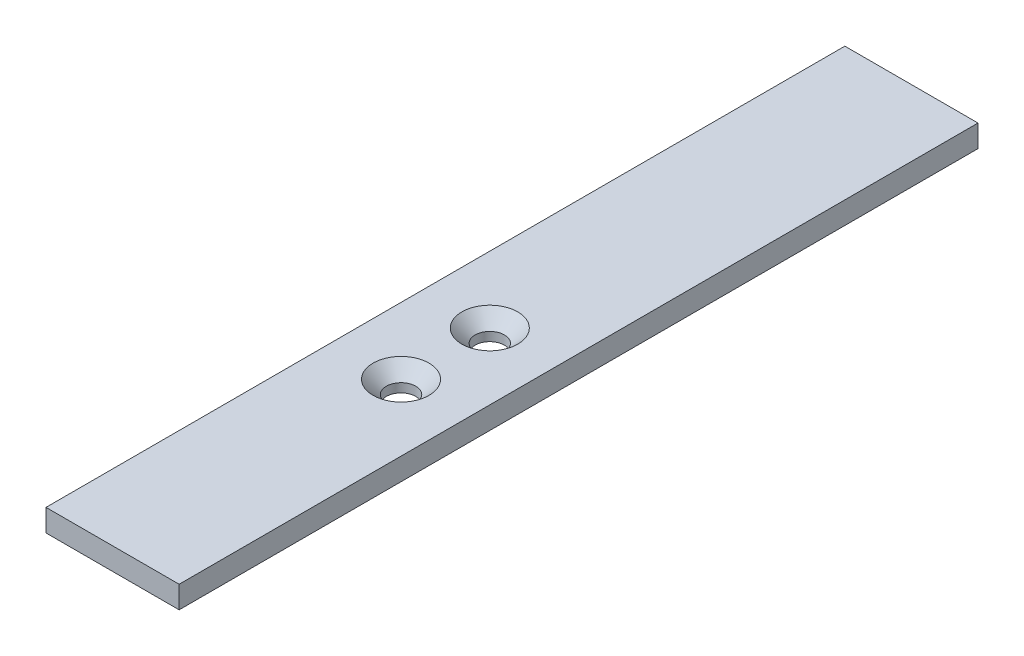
from build123d import *

# Parameters (mm, degrees)
ESQUISSE1_W                                    = 30
ESQUISSE1_H                                    = 5
EXTRUSION1_DEPTH                               = 180
FRAISAGE_POUR_VIS_T_TE_FRAIS_E_M61_D           = 6.6
FRAISAGE_POUR_VIS_T_TE_FRAIS_E_M61_DEPTH       = 25
FRAISAGE_POUR_VIS_T_TE_FRAIS_E_M61_CSINK_D     = 12.6
FRAISAGE_POUR_VIS_T_TE_FRAIS_E_M61_CSINK_ANGLE = 90
FRAISAGE_POUR_VIS_T_TE_FRAIS_E_M61_TIP         = 1.982840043


with BuildPart() as part:
    # Esquisse1 → Extrusion1 (new body)
    with BuildSketch(Plane.XY):
        Rectangle(ESQUISSE1_W, ESQUISSE1_H)
    extrude(amount=EXTRUSION1_DEPTH)

    # Fraisage pour vis _ t_te frais_e M61
    with Locations(Plane(origin=(0, 2.5, 0), x_dir=(-1, 0, 0), z_dir=(0, 1, 0))):
        with Locations((0, 115), (0, 95)):
            CounterSinkHole(FRAISAGE_POUR_VIS_T_TE_FRAIS_E_M61_D / 2, FRAISAGE_POUR_VIS_T_TE_FRAIS_E_M61_CSINK_D / 2, depth=FRAISAGE_POUR_VIS_T_TE_FRAIS_E_M61_DEPTH, counter_sink_angle=FRAISAGE_POUR_VIS_T_TE_FRAIS_E_M61_CSINK_ANGLE)
            with Locations((0, 0, -(FRAISAGE_POUR_VIS_T_TE_FRAIS_E_M61_DEPTH + FRAISAGE_POUR_VIS_T_TE_FRAIS_E_M61_TIP / 2))):  # 118° drill point
                Cone(0, FRAISAGE_POUR_VIS_T_TE_FRAIS_E_M61_D / 2, FRAISAGE_POUR_VIS_T_TE_FRAIS_E_M61_TIP, mode=Mode.SUBTRACT)


solid = part.part
